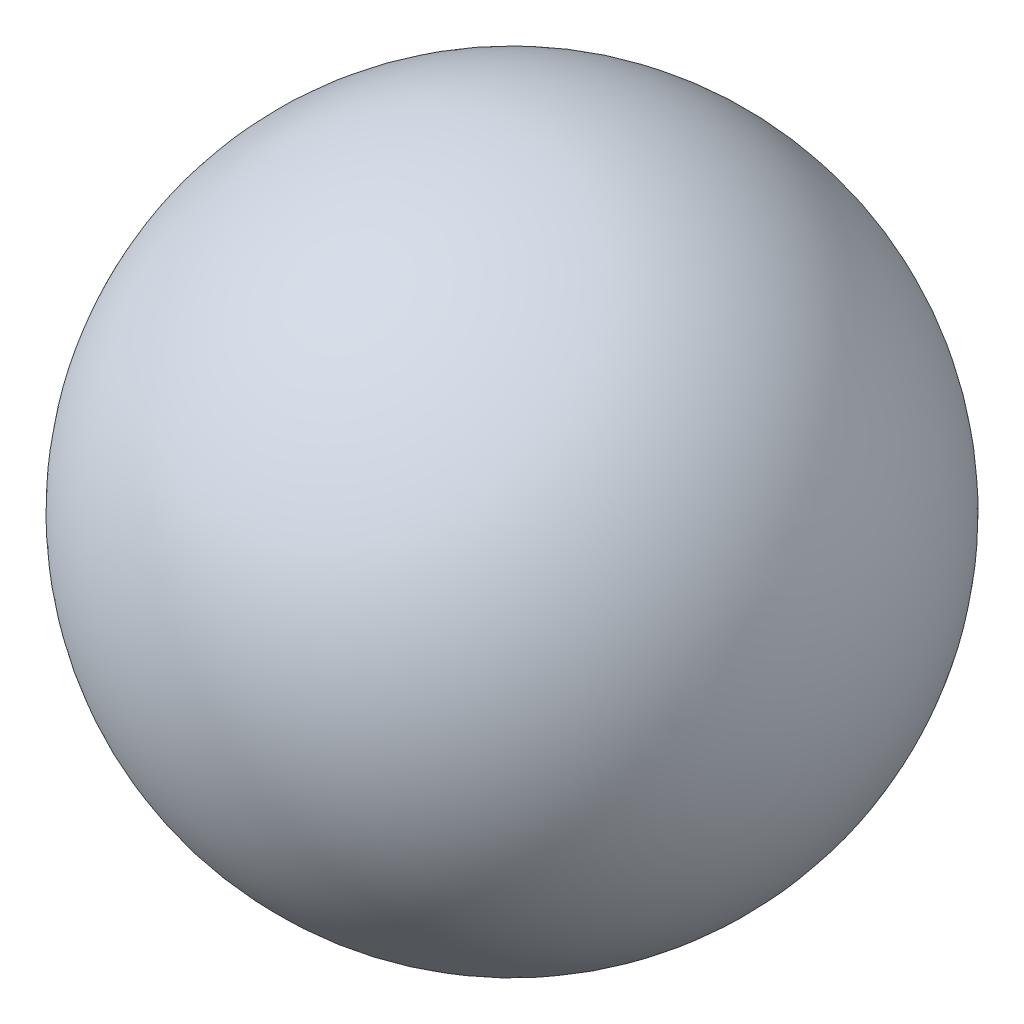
from build123d import *


with BuildPart() as part:
    # Esquisse1 → Base-R_volution (revolve)
    with BuildSketch(Plane(origin=(0, 0, 0), x_dir=(1, 0, 0), z_dir=(0, 1, 0))):
        with BuildLine():
            Line((0.75, 2.95), (4.65, 2.95))
            ThreePointArc((4.65, 2.95), (2.7, 4.9), (0.75, 2.95))
        make_face()
    revolve(axis=Axis((-0.3, 0, -2.95), (1, 0, 0)))


solid = part.part
